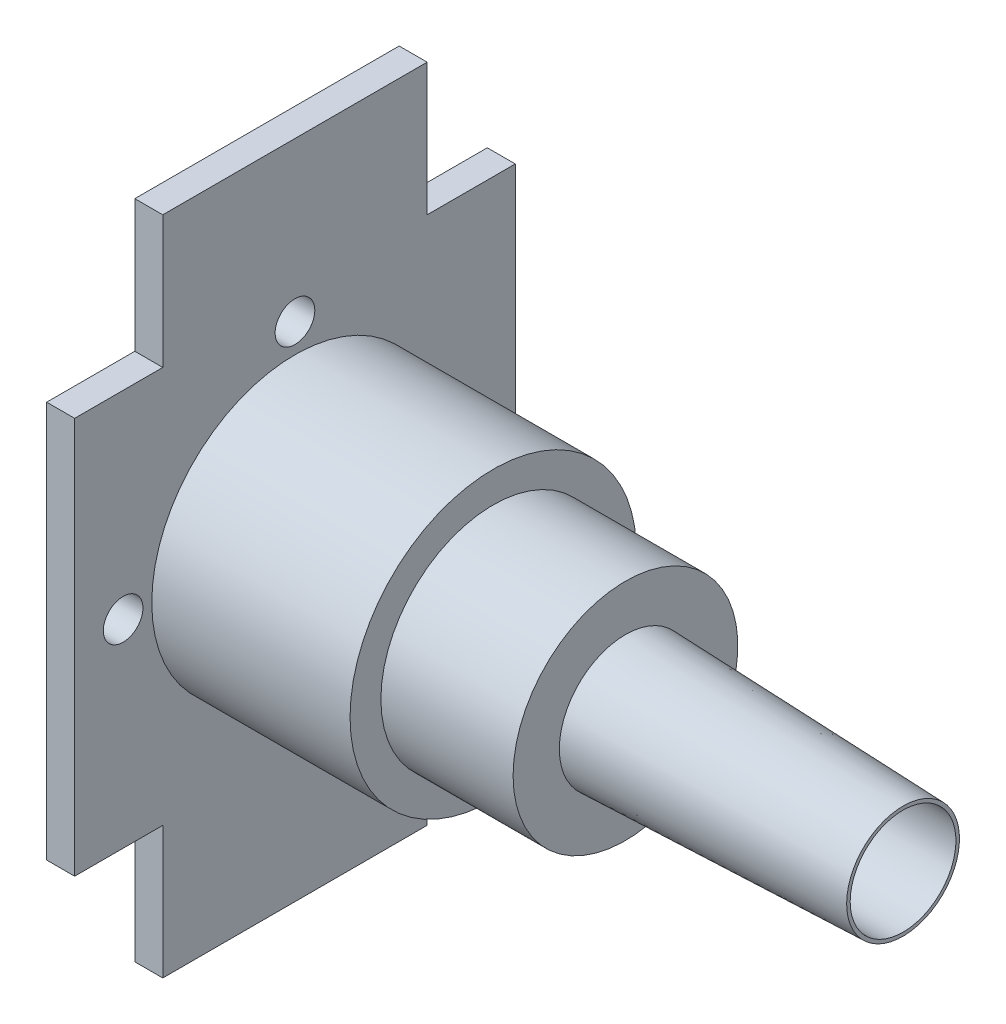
from build123d import *

# Parameters (mm, degrees)
SKETCH1_W            = 150
SKETCH1_H            = 100
BOSS_EXTRUDE1_DEPTH  = 6.35
SKETCH2_R            = 4.5
CUT_EXTRUDE1_DEPTH   = 118.260393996
CIRPATTERN1_COUNT    = 4
SKETCH6_R            = 15
BOSS_EXTRUDE2_DEPTH  = 63
BOSS_EXTRUDE2_DRAFT  = -2
SKETCH8_W            = 20
SKETCH8_H            = 30
CUT_EXTRUDE3_DEPTH   = 165.830215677
LPATTERN1_COUNT      = 2
LPATTERN1_PITCH      = 120
LPATTERN1_COUNT_DIR2 = 2
LPATTERN1_PITCH_DIR2 = 80


with BuildPart() as part:
    # Sketch1 → Boss-Extrude1 (new body)
    with BuildSketch(Plane(origin=(0, 0, 0), x_dir=(0, -1, 0), z_dir=(1, 0, 0))):
        Rectangle(SKETCH1_W, SKETCH1_H)
    extrude(amount=BOSS_EXTRUDE1_DEPTH)

    # Sketch5 → Revolve1 (revolve)
    with BuildSketch(Plane.XY, mode=Mode.PRIVATE) as revolve1_sk:
        Polygon((6.35, 0), (81.35, 0), (81.35, -25.5), (51.35, -25.5), (51.35, -32.5), (6.35, -32.5), align=None)
    revolve(revolve1_sk.sketch.rotate(Axis((6.35, 0, 0), (1, 0, 0)), 270), axis=Axis((6.35, 0, 0), (1, 0, 0)))

    # Sketch2 → Cut-Extrude1 (cut, through all)
    with BuildSketch(Plane(origin=(6.35, 0, 0), x_dir=(0, -1, 0), z_dir=(1, 0, 0))):
        with Locations(Location((-39, 0, 0), (0, 0, 180))):
            Circle(SKETCH2_R)
    cut_extrude1 = extrude(amount=-CUT_EXTRUDE1_DEPTH, mode=Mode.SUBTRACT)

    # CirPattern1: Cut-Extrude1 ×4 about axis
    cirpattern1_axis = Axis((0, 0, 0), (1, 0, 0))
    for i in range(1, CIRPATTERN1_COUNT):
        add(cut_extrude1.rotate(cirpattern1_axis, i * 360 / CIRPATTERN1_COUNT), mode=Mode.SUBTRACT)


with BuildPart() as boss_extrude2_tool:
    # Sketch6 → Boss-Extrude2 (with draft: the straight prism first)
    with BuildSketch(Plane(origin=(81.35, 0, 0), x_dir=(0, 1, 0), z_dir=(-1, 0, 0))):
        Circle(SKETCH6_R)
    extrude(amount=-BOSS_EXTRUDE2_DEPTH)
    # Boss-Extrude2: the draft: its side faces are tilted about the plane it starts from
    boss_extrude2_sides = [boss_extrude2_tool.faces().sort_by_distance(p)[0] for p in [
        (112.85, -15, 0),
    ]]
    draft(boss_extrude2_sides, Plane(origin=(81.35, 0, 0), x_dir=(0, 1, 0), z_dir=(-1, 0, 0)), BOSS_EXTRUDE2_DRAFT)


with BuildPart() as part_1:
    add(part.part)

    # Boss-Extrude2: add boss_extrude2_tool
    add(boss_extrude2_tool.part)

    # Sketch8 → Cut-Extrude3 (cut, through all)
    with BuildSketch(Plane(origin=(6.35, 0, 0), x_dir=(0, 0, -1), z_dir=(1, 0, 0))):
        with Locations((-40, 60)):
            Rectangle(SKETCH8_W, SKETCH8_H)
    cut_extrude3 = extrude(amount=-CUT_EXTRUDE3_DEPTH, mode=Mode.SUBTRACT)

    # LPattern1: Cut-Extrude3 2 × 2
    with Locations(*[(0, -i * LPATTERN1_PITCH, -j * LPATTERN1_PITCH_DIR2) for i in range(LPATTERN1_COUNT) for j in range(LPATTERN1_COUNT_DIR2) if (i, j) != (0, 0)]):
        add(cut_extrude3, mode=Mode.SUBTRACT)

    # Sketch9 → Cut-Revolve1 (revolve, cut)
    with BuildSketch(Plane.XY, mode=Mode.PRIVATE) as cut_revolve1_sk:
        Polygon((144.35, 12), (114.35, 12), (114.35, 11), (81.35, 11), (81.35, 0), (144.35, 0), align=None)
    revolve(cut_revolve1_sk.sketch.rotate(Axis((81.35, 0, 0), (1, 0, 0)), 90), axis=Axis((81.35, 0, 0), (1, 0, 0)), mode=Mode.SUBTRACT)


solid = part_1.part
